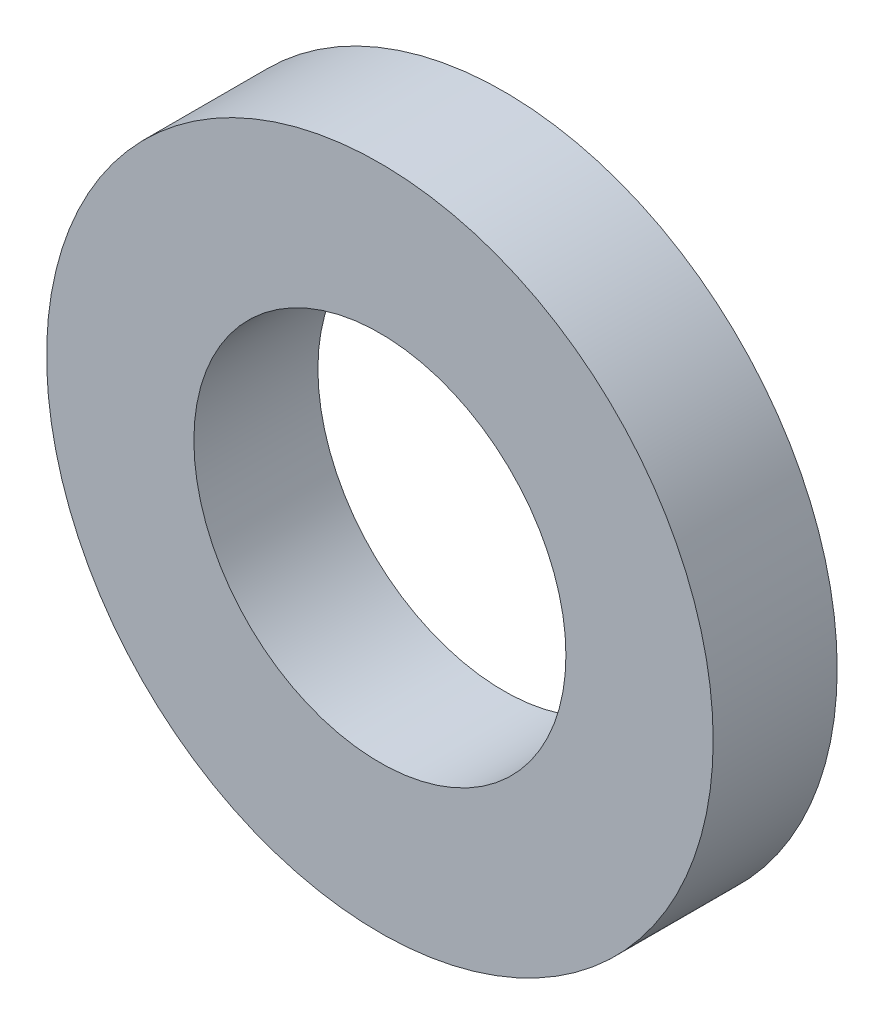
ISO-10303-21;
HEADER;
FILE_DESCRIPTION(('STEP AP214'),'2;1');
FILE_NAME('part.step','',(''),(''),'','','');
FILE_SCHEMA(('AUTOMOTIVE_DESIGN { 1 0 10303 214 1 1 1 1 }'));
ENDSEC;
DATA;
#1=APPLICATION_CONTEXT('core data for automotive mechanical design processes');
#2=APPLICATION_PROTOCOL_DEFINITION('international standard','automotive_design',2000,#1);
#3=PRODUCT_CONTEXT('',#1,'mechanical');
#4=PRODUCT('Part','Part','',(#3));
#5=PRODUCT_RELATED_PRODUCT_CATEGORY('part','',(#4));
#6=PRODUCT_DEFINITION_FORMATION('','',#4);
#7=PRODUCT_DEFINITION_CONTEXT('part definition',#1,'design');
#8=PRODUCT_DEFINITION('design','',#6,#7);
#9=PRODUCT_DEFINITION_SHAPE('','',#8);
#10=(LENGTH_UNIT() NAMED_UNIT(*) SI_UNIT(.MILLI.,.METRE.));
#11=(NAMED_UNIT(*) PLANE_ANGLE_UNIT() SI_UNIT($,.RADIAN.));
#12=(NAMED_UNIT(*) SI_UNIT($,.STERADIAN.) SOLID_ANGLE_UNIT());
#13=UNCERTAINTY_MEASURE_WITH_UNIT(LENGTH_MEASURE(1.E-05),#10,'distance_accuracy_value','');
#14=(GEOMETRIC_REPRESENTATION_CONTEXT(3) GLOBAL_UNCERTAINTY_ASSIGNED_CONTEXT((#13)) GLOBAL_UNIT_ASSIGNED_CONTEXT((#10,
#11,#12)) REPRESENTATION_CONTEXT('',''));
#15=CARTESIAN_POINT('',(0.,0.,0.));
#16=DIRECTION('',(0.,0.,1.));
#17=DIRECTION('',(1.,0.,0.));
#18=AXIS2_PLACEMENT_3D('',#15,#16,#17);
#19=CARTESIAN_POINT('',(0.,0.,0.));
#20=DIRECTION('',(0.,0.,1.));
#21=DIRECTION('',(1.,0.,0.));
#22=AXIS2_PLACEMENT_3D('',#19,#20,#21);
#23=CYLINDRICAL_SURFACE('',#22,60.);
#24=CARTESIAN_POINT('',(0.,0.,0.));
#25=DIRECTION('',(0.,0.,-1.));
#26=DIRECTION('',(-1.,0.,0.));
#27=AXIS2_PLACEMENT_3D('',#24,#25,#26);
#28=CIRCLE('',#27,60.);
#29=CARTESIAN_POINT('',(60.,0.,0.));
#30=VERTEX_POINT('',#29);
#31=EDGE_CURVE('E10',#30,#30,#28,.T.);
#32=ORIENTED_EDGE('',*,*,#31,.T.);
#33=DIRECTION('',(0.,0.,1.));
#34=VECTOR('',#33,1.);
#35=CARTESIAN_POINT('',(60.,0.,20.));
#36=LINE('',#35,#34);
#37=CARTESIAN_POINT('',(60.,0.,40.));
#38=VERTEX_POINT('',#37);
#39=EDGE_CURVE('E24',#30,#38,#36,.T.);
#40=ORIENTED_EDGE('',*,*,#39,.T.);
#41=CARTESIAN_POINT('',(0.,0.,40.));
#42=DIRECTION('',(0.,0.,1.));
#43=DIRECTION('',(1.,0.,0.));
#44=AXIS2_PLACEMENT_3D('',#41,#42,#43);
#45=CIRCLE('',#44,60.);
#46=EDGE_CURVE('E35',#38,#38,#45,.T.);
#47=ORIENTED_EDGE('',*,*,#46,.T.);
#48=ORIENTED_EDGE('',*,*,#39,.F.);
#49=EDGE_LOOP('',(#32,#40,#47,#48));
#50=FACE_BOUND('',#49,.T.);
#51=ADVANCED_FACE('F15',(#50),#23,.F.);
#52=CARTESIAN_POINT('',(0.,0.,0.));
#53=DIRECTION('',(0.,0.,1.));
#54=DIRECTION('',(1.,0.,0.));
#55=AXIS2_PLACEMENT_3D('',#52,#53,#54);
#56=CYLINDRICAL_SURFACE('',#55,107.5);
#57=CARTESIAN_POINT('',(0.,0.,0.));
#58=DIRECTION('',(0.,0.,1.));
#59=DIRECTION('',(1.,0.,0.));
#60=AXIS2_PLACEMENT_3D('',#57,#58,#59);
#61=CIRCLE('',#60,107.5);
#62=CARTESIAN_POINT('',(107.5,0.,0.));
#63=VERTEX_POINT('',#62);
#64=EDGE_CURVE('E48',#63,#63,#61,.T.);
#65=ORIENTED_EDGE('',*,*,#64,.T.);
#66=DIRECTION('',(0.,0.,-1.));
#67=VECTOR('',#66,1.);
#68=CARTESIAN_POINT('',(107.5,0.,20.));
#69=LINE('',#68,#67);
#70=CARTESIAN_POINT('',(107.5,0.,40.));
#71=VERTEX_POINT('',#70);
#72=EDGE_CURVE('E19',#71,#63,#69,.T.);
#73=ORIENTED_EDGE('',*,*,#72,.F.);
#74=CARTESIAN_POINT('',(0.,1.00652496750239E-13,40.));
#75=DIRECTION('',(0.,0.,-1.));
#76=DIRECTION('',(-1.,0.,0.));
#77=AXIS2_PLACEMENT_3D('',#74,#75,#76);
#78=CIRCLE('',#77,107.5);
#79=EDGE_CURVE('E43',#71,#71,#78,.T.);
#80=ORIENTED_EDGE('',*,*,#79,.T.);
#81=ORIENTED_EDGE('',*,*,#72,.T.);
#82=EDGE_LOOP('',(#65,#73,#80,#81));
#83=FACE_BOUND('',#82,.T.);
#84=ADVANCED_FACE('F56',(#83),#56,.T.);
#85=CARTESIAN_POINT('',(112.874999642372,-112.874999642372,40.));
#86=DIRECTION('',(0.,0.,1.));
#87=DIRECTION('',(0.,1.,0.));
#88=AXIS2_PLACEMENT_3D('',#85,#86,#87);
#89=PLANE('',#88);
#90=ORIENTED_EDGE('',*,*,#46,.F.);
#91=EDGE_LOOP('',(#90));
#92=FACE_BOUND('',#91,.T.);
#93=ORIENTED_EDGE('',*,*,#79,.F.);
#94=EDGE_LOOP('',(#93));
#95=FACE_BOUND('',#94,.T.);
#96=ADVANCED_FACE('F44',(#92,#95),#89,.T.);
#97=CARTESIAN_POINT('',(-112.874999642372,112.874999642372,0.));
#98=DIRECTION('',(0.,0.,-1.));
#99=DIRECTION('',(1.,0.,0.));
#100=AXIS2_PLACEMENT_3D('',#97,#98,#99);
#101=PLANE('',#100);
#102=ORIENTED_EDGE('',*,*,#31,.F.);
#103=EDGE_LOOP('',(#102));
#104=FACE_BOUND('',#103,.T.);
#105=ORIENTED_EDGE('',*,*,#64,.F.);
#106=EDGE_LOOP('',(#105));
#107=FACE_BOUND('',#106,.T.);
#108=ADVANCED_FACE('F17',(#104,#107),#101,.T.);
#109=CLOSED_SHELL('',(#51,#84,#96,#108));
#110=MANIFOLD_SOLID_BREP('B1',#109);
#111=ADVANCED_BREP_SHAPE_REPRESENTATION('',(#18,#110),#14);
#112=SHAPE_DEFINITION_REPRESENTATION(#9,#111);
ENDSEC;
END-ISO-10303-21;
